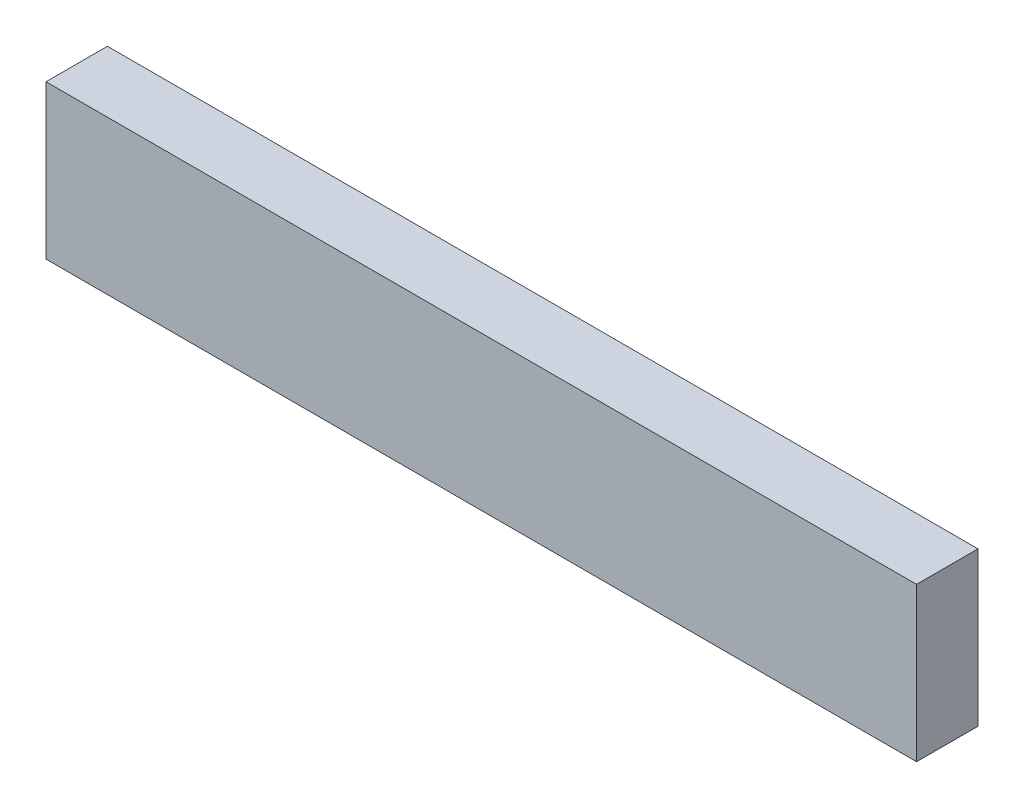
from build123d import *

# Parameters (mm, degrees)
SKETCH1_W           = 170
SKETCH1_H           = 30
BOSS_EXTRUDE1_DEPTH = 12


with BuildPart() as part:
    # Sketch1 → Boss-Extrude1 (new body)
    with BuildSketch(Plane.XY):
        with Locations((-85, 15)):
            Rectangle(SKETCH1_W, SKETCH1_H)
    extrude(amount=BOSS_EXTRUDE1_DEPTH)


solid = part.part
